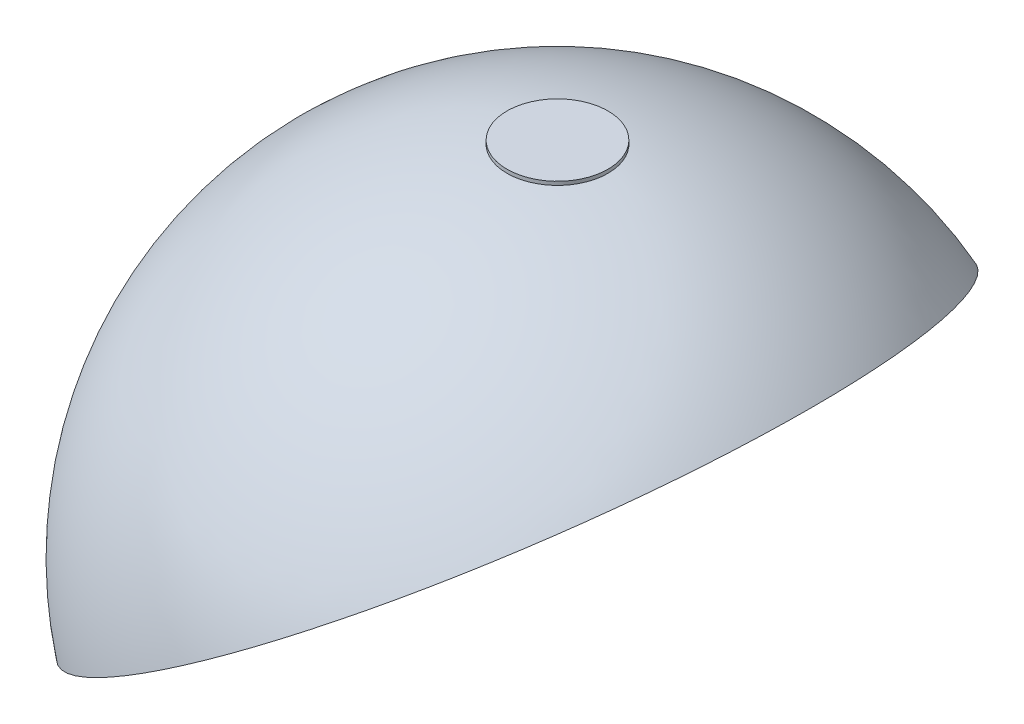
from build123d import *

# Parameters (mm, degrees)
SZKIC4_W = 6.98064687
SZKIC4_H = 0.700004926


with BuildPart() as part:
    # Szkic3 → Obr_t1 (revolve)
    with BuildSketch(Plane.XY):
        with BuildLine():
            Line((35.149486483, 35.56), (29.192067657, 31.572506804))
            Line((29.192067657, 31.572506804), (22.694514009, 41.280021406))
            Line((22.694514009, 41.280021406), (-10.041306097, 41.811148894))
            Line((-10.041306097, 41.811148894), (-23.918014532, 35.734137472))
            Line((-23.918014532, 35.734137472), (-27.811644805, 41.551322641))
            ThreePointArc((-27.811644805, 41.551322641), (4.736556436, 49.775144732), (35.149486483, 35.56))
        make_face()
    revolve(axis=Axis((-27.811644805, 41.551322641, 0), (0.5562328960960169, -0.831026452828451, 0)))

    # Szkic4 → Obr_t2 (revolve)
    with BuildSketch(Plane.XY, mode=Mode.PRIVATE) as obr_t2_sk:
        with Locations((3.490323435, 49.654987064)):
            Rectangle(SZKIC4_W, SZKIC4_H)
    revolve(obr_t2_sk.sketch.rotate(Axis((0, 50.004989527, 0), (0, -1, 0)), 90), axis=Axis((0, 50.004989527, 0), (0, -1, 0)))


solid = part.part
